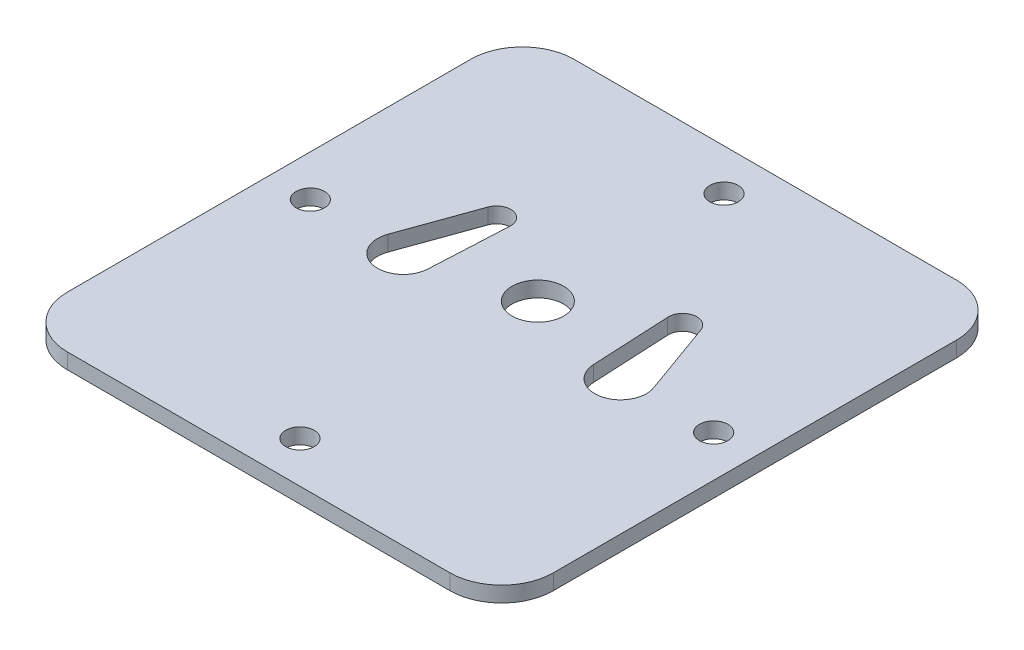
ISO-10303-21;
HEADER;
FILE_DESCRIPTION(('STEP AP214'),'2;1');
FILE_NAME('part.step','',(''),(''),'','','');
FILE_SCHEMA(('AUTOMOTIVE_DESIGN { 1 0 10303 214 1 1 1 1 }'));
ENDSEC;
DATA;
#1=APPLICATION_CONTEXT('core data for automotive mechanical design processes');
#2=APPLICATION_PROTOCOL_DEFINITION('international standard','automotive_design',2000,#1);
#3=PRODUCT_CONTEXT('',#1,'mechanical');
#4=PRODUCT('Part','Part','',(#3));
#5=PRODUCT_RELATED_PRODUCT_CATEGORY('part','',(#4));
#6=PRODUCT_DEFINITION_FORMATION('','',#4);
#7=PRODUCT_DEFINITION_CONTEXT('part definition',#1,'design');
#8=PRODUCT_DEFINITION('design','',#6,#7);
#9=PRODUCT_DEFINITION_SHAPE('','',#8);
#10=(LENGTH_UNIT() NAMED_UNIT(*) SI_UNIT(.MILLI.,.METRE.));
#11=(NAMED_UNIT(*) PLANE_ANGLE_UNIT() SI_UNIT($,.RADIAN.));
#12=(NAMED_UNIT(*) SI_UNIT($,.STERADIAN.) SOLID_ANGLE_UNIT());
#13=UNCERTAINTY_MEASURE_WITH_UNIT(LENGTH_MEASURE(1.E-05),#10,'distance_accuracy_value','');
#14=(GEOMETRIC_REPRESENTATION_CONTEXT(3) GLOBAL_UNCERTAINTY_ASSIGNED_CONTEXT((#13)) GLOBAL_UNIT_ASSIGNED_CONTEXT((#10,
#11,#12)) REPRESENTATION_CONTEXT('',''));
#15=CARTESIAN_POINT('',(0.,0.,0.));
#16=DIRECTION('',(0.,0.,1.));
#17=DIRECTION('',(1.,0.,0.));
#18=AXIS2_PLACEMENT_3D('',#15,#16,#17);
#19=CARTESIAN_POINT('',(10.,3.,-88.));
#20=DIRECTION('',(0.,-1.,0.));
#21=DIRECTION('',(0.,0.,-1.));
#22=AXIS2_PLACEMENT_3D('',#19,#20,#21);
#23=PLANE('',#22);
#24=CARTESIAN_POINT('',(65.,3.,-64.));
#25=DIRECTION('',(0.,1.,0.));
#26=DIRECTION('',(0.,0.,-1.));
#27=AXIS2_PLACEMENT_3D('',#24,#25,#26);
#28=CIRCLE('',#27,2.75);
#29=CARTESIAN_POINT('',(67.5879405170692,3.,-64.9300881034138));
#30=VERTEX_POINT('',#29);
#31=CARTESIAN_POINT('',(62.253405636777,3.,-63.8631811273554));
#32=VERTEX_POINT('',#31);
#33=EDGE_CURVE('E179',#30,#32,#28,.T.);
#34=ORIENTED_EDGE('',*,*,#33,.F.);
#35=DIRECTION('',(-0.338213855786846,0.,-0.941069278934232));
#36=VECTOR('',#35,1.);
#37=CARTESIAN_POINT('',(67.5879405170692,3.,-64.9300881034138));
#38=LINE('',#37,#36);
#39=CARTESIAN_POINT('',(72.7053463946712,3.,-50.6910692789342));
#40=VERTEX_POINT('',#39);
#41=EDGE_CURVE('E187',#40,#30,#38,.T.);
#42=ORIENTED_EDGE('',*,*,#41,.F.);
#43=CARTESIAN_POINT('',(68.,3.,-49.));
#44=DIRECTION('',(0.,1.,0.));
#45=DIRECTION('',(0.,0.,-1.));
#46=AXIS2_PLACEMENT_3D('',#43,#44,#45);
#47=CIRCLE('',#46,4.99999999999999);
#48=CARTESIAN_POINT('',(63.0061920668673,3.,-48.7512384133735));
#49=VERTEX_POINT('',#48);
#50=EDGE_CURVE('E184',#49,#40,#47,.T.);
#51=ORIENTED_EDGE('',*,*,#50,.F.);
#52=DIRECTION('',(0.0497523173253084,0.,0.998761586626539));
#53=VECTOR('',#52,1.);
#54=CARTESIAN_POINT('',(62.253405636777,3.,-63.8631811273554));
#55=LINE('',#54,#53);
#56=EDGE_CURVE('E181',#32,#49,#55,.T.);
#57=ORIENTED_EDGE('',*,*,#56,.F.);
#58=EDGE_LOOP('',(#34,#42,#51,#57));
#59=FACE_BOUND('',#58,.T.);
#60=CARTESIAN_POINT('',(8.,3.,-49.));
#61=DIRECTION('',(0.,1.,0.));
#62=DIRECTION('',(0.,0.,1.));
#63=AXIS2_PLACEMENT_3D('',#60,#61,#62);
#64=CIRCLE('',#63,2.75);
#65=CARTESIAN_POINT('',(8.,3.,-46.25));
#66=VERTEX_POINT('',#65);
#67=EDGE_CURVE('E216',#66,#66,#64,.T.);
#68=ORIENTED_EDGE('',*,*,#67,.F.);
#69=EDGE_LOOP('',(#68));
#70=FACE_BOUND('',#69,.T.);
#71=CARTESIAN_POINT('',(86.,3.,-49.));
#72=DIRECTION('',(0.,1.,0.));
#73=DIRECTION('',(0.,0.,1.));
#74=AXIS2_PLACEMENT_3D('',#71,#72,#73);
#75=CIRCLE('',#74,2.75000000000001);
#76=CARTESIAN_POINT('',(86.,3.,-46.25));
#77=VERTEX_POINT('',#76);
#78=EDGE_CURVE('E228',#77,#77,#75,.T.);
#79=ORIENTED_EDGE('',*,*,#78,.F.);
#80=EDGE_LOOP('',(#79));
#81=FACE_BOUND('',#80,.T.);
#82=CARTESIAN_POINT('',(10.,3.,-88.));
#83=DIRECTION('',(0.,1.,0.));
#84=DIRECTION('',(0.,0.,-1.));
#85=AXIS2_PLACEMENT_3D('',#82,#83,#84);
#86=CIRCLE('',#85,10.);
#87=CARTESIAN_POINT('',(10.0000000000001,3.,-98.));
#88=VERTEX_POINT('',#87);
#89=CARTESIAN_POINT('',(0.,3.,-87.9999999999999));
#90=VERTEX_POINT('',#89);
#91=EDGE_CURVE('E240',#88,#90,#86,.T.);
#92=ORIENTED_EDGE('',*,*,#91,.T.);
#93=DIRECTION('',(0.,0.,1.));
#94=VECTOR('',#93,1.);
#95=CARTESIAN_POINT('',(0.,3.,-10.0000000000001));
#96=LINE('',#95,#94);
#97=CARTESIAN_POINT('',(0.,3.,-10.0000000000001));
#98=VERTEX_POINT('',#97);
#99=EDGE_CURVE('E243',#90,#98,#96,.T.);
#100=ORIENTED_EDGE('',*,*,#99,.T.);
#101=CARTESIAN_POINT('',(10.,3.,-10.));
#102=DIRECTION('',(0.,1.,0.));
#103=DIRECTION('',(0.,0.,-1.));
#104=AXIS2_PLACEMENT_3D('',#101,#102,#103);
#105=CIRCLE('',#104,10.);
#106=CARTESIAN_POINT('',(10.0000000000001,3.,0.));
#107=VERTEX_POINT('',#106);
#108=EDGE_CURVE('E246',#98,#107,#105,.T.);
#109=ORIENTED_EDGE('',*,*,#108,.T.);
#110=DIRECTION('',(1.,0.,0.));
#111=VECTOR('',#110,1.);
#112=CARTESIAN_POINT('',(10.0000000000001,3.,0.));
#113=LINE('',#112,#111);
#114=CARTESIAN_POINT('',(83.9999999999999,3.,0.));
#115=VERTEX_POINT('',#114);
#116=EDGE_CURVE('E248',#107,#115,#113,.T.);
#117=ORIENTED_EDGE('',*,*,#116,.T.);
#118=CARTESIAN_POINT('',(84.,3.,-10.));
#119=DIRECTION('',(0.,1.,0.));
#120=DIRECTION('',(0.,0.,-1.));
#121=AXIS2_PLACEMENT_3D('',#118,#119,#120);
#122=CIRCLE('',#121,10.);
#123=CARTESIAN_POINT('',(94.,3.,-10.0000000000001));
#124=VERTEX_POINT('',#123);
#125=EDGE_CURVE('E250',#115,#124,#122,.T.);
#126=ORIENTED_EDGE('',*,*,#125,.T.);
#127=DIRECTION('',(0.,0.,-1.));
#128=VECTOR('',#127,1.);
#129=CARTESIAN_POINT('',(94.,3.,-10.0000000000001));
#130=LINE('',#129,#128);
#131=CARTESIAN_POINT('',(94.,3.,-87.9999999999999));
#132=VERTEX_POINT('',#131);
#133=EDGE_CURVE('E252',#124,#132,#130,.T.);
#134=ORIENTED_EDGE('',*,*,#133,.T.);
#135=CARTESIAN_POINT('',(84.,3.,-88.));
#136=DIRECTION('',(0.,1.,0.));
#137=DIRECTION('',(0.,0.,-1.));
#138=AXIS2_PLACEMENT_3D('',#135,#136,#137);
#139=CIRCLE('',#138,9.99999999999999);
#140=CARTESIAN_POINT('',(83.9999999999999,3.,-98.));
#141=VERTEX_POINT('',#140);
#142=EDGE_CURVE('E254',#132,#141,#139,.T.);
#143=ORIENTED_EDGE('',*,*,#142,.T.);
#144=DIRECTION('',(-1.,0.,0.));
#145=VECTOR('',#144,1.);
#146=CARTESIAN_POINT('',(10.0000000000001,3.,-98.));
#147=LINE('',#146,#145);
#148=EDGE_CURVE('E256',#141,#88,#147,.T.);
#149=ORIENTED_EDGE('',*,*,#148,.T.);
#150=EDGE_LOOP('',(#92,#100,#109,#117,#126,#134,#143,#149));
#151=FACE_BOUND('',#150,.T.);
#152=CARTESIAN_POINT('',(47.,3.,-90.));
#153=DIRECTION('',(0.,1.,0.));
#154=DIRECTION('',(0.,0.,1.));
#155=AXIS2_PLACEMENT_3D('',#152,#153,#154);
#156=CIRCLE('',#155,2.75);
#157=CARTESIAN_POINT('',(47.,3.,-87.25));
#158=VERTEX_POINT('',#157);
#159=EDGE_CURVE('E234',#158,#158,#156,.T.);
#160=ORIENTED_EDGE('',*,*,#159,.F.);
#161=EDGE_LOOP('',(#160));
#162=FACE_BOUND('',#161,.T.);
#163=CARTESIAN_POINT('',(47.,3.,-8.));
#164=DIRECTION('',(0.,1.,0.));
#165=DIRECTION('',(0.,0.,1.));
#166=AXIS2_PLACEMENT_3D('',#163,#164,#165);
#167=CIRCLE('',#166,2.75);
#168=CARTESIAN_POINT('',(47.,3.,-5.25));
#169=VERTEX_POINT('',#168);
#170=EDGE_CURVE('E222',#169,#169,#167,.T.);
#171=ORIENTED_EDGE('',*,*,#170,.F.);
#172=EDGE_LOOP('',(#171));
#173=FACE_BOUND('',#172,.T.);
#174=CARTESIAN_POINT('',(47.,3.,-54.));
#175=DIRECTION('',(0.,1.,0.));
#176=DIRECTION('',(0.,0.,1.));
#177=AXIS2_PLACEMENT_3D('',#174,#175,#176);
#178=CIRCLE('',#177,5.);
#179=CARTESIAN_POINT('',(47.,3.,-49.));
#180=VERTEX_POINT('',#179);
#181=EDGE_CURVE('E210',#180,#180,#178,.T.);
#182=ORIENTED_EDGE('',*,*,#181,.F.);
#183=EDGE_LOOP('',(#182));
#184=FACE_BOUND('',#183,.T.);
#185=CARTESIAN_POINT('',(29.,3.,-64.));
#186=DIRECTION('',(0.,1.,0.));
#187=DIRECTION('',(0.,0.,1.));
#188=AXIS2_PLACEMENT_3D('',#185,#186,#187);
#189=CIRCLE('',#188,2.75);
#190=CARTESIAN_POINT('',(31.746594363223,3.,-63.8631811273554));
#191=VERTEX_POINT('',#190);
#192=CARTESIAN_POINT('',(26.4120594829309,3.,-64.9300881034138));
#193=VERTEX_POINT('',#192);
#194=EDGE_CURVE('E143',#191,#193,#189,.T.);
#195=ORIENTED_EDGE('',*,*,#194,.F.);
#196=DIRECTION('',(0.0497523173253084,0.,-0.998761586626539));
#197=VECTOR('',#196,1.);
#198=CARTESIAN_POINT('',(31.746594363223,3.,-63.8631811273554));
#199=LINE('',#198,#197);
#200=CARTESIAN_POINT('',(30.9938079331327,3.,-48.7512384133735));
#201=VERTEX_POINT('',#200);
#202=EDGE_CURVE('E165',#201,#191,#199,.T.);
#203=ORIENTED_EDGE('',*,*,#202,.F.);
#204=CARTESIAN_POINT('',(26.,3.,-49.));
#205=DIRECTION('',(0.,1.,0.));
#206=DIRECTION('',(0.,0.,1.));
#207=AXIS2_PLACEMENT_3D('',#204,#205,#206);
#208=CIRCLE('',#207,4.99999999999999);
#209=CARTESIAN_POINT('',(21.2946536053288,3.,-50.6910692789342));
#210=VERTEX_POINT('',#209);
#211=EDGE_CURVE('E163',#210,#201,#208,.T.);
#212=ORIENTED_EDGE('',*,*,#211,.F.);
#213=DIRECTION('',(-0.338213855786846,0.,0.941069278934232));
#214=VECTOR('',#213,1.);
#215=CARTESIAN_POINT('',(26.4120594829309,3.,-64.9300881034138));
#216=LINE('',#215,#214);
#217=EDGE_CURVE('E151',#193,#210,#216,.T.);
#218=ORIENTED_EDGE('',*,*,#217,.F.);
#219=EDGE_LOOP('',(#195,#203,#212,#218));
#220=FACE_BOUND('',#219,.T.);
#221=ADVANCED_FACE('F30',(#59,#70,#81,#151,#162,#173,#184,#220),#23,.F.);
#222=CARTESIAN_POINT('',(10.,0.,-88.));
#223=DIRECTION('',(0.,-1.,0.));
#224=DIRECTION('',(0.,0.,-1.));
#225=AXIS2_PLACEMENT_3D('',#222,#223,#224);
#226=PLANE('',#225);
#227=DIRECTION('',(-0.338213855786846,0.,-0.941069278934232));
#228=VECTOR('',#227,1.);
#229=CARTESIAN_POINT('',(67.5879405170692,0.,-64.9300881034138));
#230=LINE('',#229,#228);
#231=CARTESIAN_POINT('',(72.7053463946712,0.,-50.6910692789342));
#232=VERTEX_POINT('',#231);
#233=CARTESIAN_POINT('',(67.5879405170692,0.,-64.9300881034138));
#234=VERTEX_POINT('',#233);
#235=EDGE_CURVE('E182',#232,#234,#230,.T.);
#236=ORIENTED_EDGE('',*,*,#235,.T.);
#237=CARTESIAN_POINT('',(65.,0.,-64.));
#238=DIRECTION('',(0.,1.,0.));
#239=DIRECTION('',(0.,0.,-1.));
#240=AXIS2_PLACEMENT_3D('',#237,#238,#239);
#241=CIRCLE('',#240,2.75);
#242=CARTESIAN_POINT('',(62.253405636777,0.,-63.8631811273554));
#243=VERTEX_POINT('',#242);
#244=EDGE_CURVE('E159',#234,#243,#241,.T.);
#245=ORIENTED_EDGE('',*,*,#244,.T.);
#246=DIRECTION('',(0.0497523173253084,0.,0.998761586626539));
#247=VECTOR('',#246,1.);
#248=CARTESIAN_POINT('',(62.253405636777,0.,-63.8631811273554));
#249=LINE('',#248,#247);
#250=CARTESIAN_POINT('',(63.0061920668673,0.,-48.7512384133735));
#251=VERTEX_POINT('',#250);
#252=EDGE_CURVE('E192',#243,#251,#249,.T.);
#253=ORIENTED_EDGE('',*,*,#252,.T.);
#254=CARTESIAN_POINT('',(68.,0.,-49.));
#255=DIRECTION('',(0.,1.,0.));
#256=DIRECTION('',(0.,0.,-1.));
#257=AXIS2_PLACEMENT_3D('',#254,#255,#256);
#258=CIRCLE('',#257,4.99999999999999);
#259=EDGE_CURVE('E195',#251,#232,#258,.T.);
#260=ORIENTED_EDGE('',*,*,#259,.T.);
#261=EDGE_LOOP('',(#236,#245,#253,#260));
#262=FACE_BOUND('',#261,.T.);
#263=CARTESIAN_POINT('',(8.,0.,-49.));
#264=DIRECTION('',(0.,1.,0.));
#265=DIRECTION('',(0.,0.,1.));
#266=AXIS2_PLACEMENT_3D('',#263,#264,#265);
#267=CIRCLE('',#266,2.75);
#268=CARTESIAN_POINT('',(8.,0.,-46.25));
#269=VERTEX_POINT('',#268);
#270=EDGE_CURVE('E213',#269,#269,#267,.T.);
#271=ORIENTED_EDGE('',*,*,#270,.T.);
#272=EDGE_LOOP('',(#271));
#273=FACE_BOUND('',#272,.T.);
#274=CARTESIAN_POINT('',(86.,0.,-49.));
#275=DIRECTION('',(0.,1.,0.));
#276=DIRECTION('',(0.,0.,1.));
#277=AXIS2_PLACEMENT_3D('',#274,#275,#276);
#278=CIRCLE('',#277,2.75000000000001);
#279=CARTESIAN_POINT('',(86.,0.,-46.25));
#280=VERTEX_POINT('',#279);
#281=EDGE_CURVE('E225',#280,#280,#278,.T.);
#282=ORIENTED_EDGE('',*,*,#281,.T.);
#283=EDGE_LOOP('',(#282));
#284=FACE_BOUND('',#283,.T.);
#285=CARTESIAN_POINT('',(10.,0.,-88.));
#286=DIRECTION('',(0.,1.,0.));
#287=DIRECTION('',(0.,0.,-1.));
#288=AXIS2_PLACEMENT_3D('',#285,#286,#287);
#289=CIRCLE('',#288,10.);
#290=CARTESIAN_POINT('',(10.0000000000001,0.,-98.));
#291=VERTEX_POINT('',#290);
#292=CARTESIAN_POINT('',(0.,0.,-87.9999999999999));
#293=VERTEX_POINT('',#292);
#294=EDGE_CURVE('E237',#291,#293,#289,.T.);
#295=ORIENTED_EDGE('',*,*,#294,.F.);
#296=DIRECTION('',(-1.,0.,0.));
#297=VECTOR('',#296,1.);
#298=CARTESIAN_POINT('',(10.0000000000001,0.,-98.));
#299=LINE('',#298,#297);
#300=CARTESIAN_POINT('',(83.9999999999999,0.,-98.));
#301=VERTEX_POINT('',#300);
#302=EDGE_CURVE('E244',#301,#291,#299,.T.);
#303=ORIENTED_EDGE('',*,*,#302,.F.);
#304=CARTESIAN_POINT('',(84.,0.,-88.));
#305=DIRECTION('',(0.,1.,0.));
#306=DIRECTION('',(0.,0.,-1.));
#307=AXIS2_PLACEMENT_3D('',#304,#305,#306);
#308=CIRCLE('',#307,9.99999999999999);
#309=CARTESIAN_POINT('',(94.,0.,-87.9999999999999));
#310=VERTEX_POINT('',#309);
#311=EDGE_CURVE('E271',#310,#301,#308,.T.);
#312=ORIENTED_EDGE('',*,*,#311,.F.);
#313=DIRECTION('',(0.,0.,-1.));
#314=VECTOR('',#313,1.);
#315=CARTESIAN_POINT('',(94.,0.,-10.0000000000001));
#316=LINE('',#315,#314);
#317=CARTESIAN_POINT('',(94.,0.,-10.0000000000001));
#318=VERTEX_POINT('',#317);
#319=EDGE_CURVE('E269',#318,#310,#316,.T.);
#320=ORIENTED_EDGE('',*,*,#319,.F.);
#321=CARTESIAN_POINT('',(84.,0.,-10.));
#322=DIRECTION('',(0.,1.,0.));
#323=DIRECTION('',(0.,0.,-1.));
#324=AXIS2_PLACEMENT_3D('',#321,#322,#323);
#325=CIRCLE('',#324,10.);
#326=CARTESIAN_POINT('',(83.9999999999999,0.,0.));
#327=VERTEX_POINT('',#326);
#328=EDGE_CURVE('E267',#327,#318,#325,.T.);
#329=ORIENTED_EDGE('',*,*,#328,.F.);
#330=DIRECTION('',(1.,0.,0.));
#331=VECTOR('',#330,1.);
#332=CARTESIAN_POINT('',(10.0000000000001,0.,0.));
#333=LINE('',#332,#331);
#334=CARTESIAN_POINT('',(10.0000000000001,0.,0.));
#335=VERTEX_POINT('',#334);
#336=EDGE_CURVE('E265',#335,#327,#333,.T.);
#337=ORIENTED_EDGE('',*,*,#336,.F.);
#338=CARTESIAN_POINT('',(10.,0.,-10.));
#339=DIRECTION('',(0.,1.,0.));
#340=DIRECTION('',(0.,0.,-1.));
#341=AXIS2_PLACEMENT_3D('',#338,#339,#340);
#342=CIRCLE('',#341,10.);
#343=CARTESIAN_POINT('',(0.,0.,-10.0000000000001));
#344=VERTEX_POINT('',#343);
#345=EDGE_CURVE('E263',#344,#335,#342,.T.);
#346=ORIENTED_EDGE('',*,*,#345,.F.);
#347=DIRECTION('',(0.,0.,1.));
#348=VECTOR('',#347,1.);
#349=CARTESIAN_POINT('',(0.,0.,-10.0000000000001));
#350=LINE('',#349,#348);
#351=EDGE_CURVE('E261',#293,#344,#350,.T.);
#352=ORIENTED_EDGE('',*,*,#351,.F.);
#353=EDGE_LOOP('',(#295,#303,#312,#320,#329,#337,#346,#352));
#354=FACE_BOUND('',#353,.T.);
#355=CARTESIAN_POINT('',(47.,0.,-90.));
#356=DIRECTION('',(0.,1.,0.));
#357=DIRECTION('',(0.,0.,1.));
#358=AXIS2_PLACEMENT_3D('',#355,#356,#357);
#359=CIRCLE('',#358,2.75);
#360=CARTESIAN_POINT('',(47.,0.,-87.25));
#361=VERTEX_POINT('',#360);
#362=EDGE_CURVE('E231',#361,#361,#359,.T.);
#363=ORIENTED_EDGE('',*,*,#362,.T.);
#364=EDGE_LOOP('',(#363));
#365=FACE_BOUND('',#364,.T.);
#366=CARTESIAN_POINT('',(47.,0.,-8.));
#367=DIRECTION('',(0.,1.,0.));
#368=DIRECTION('',(0.,0.,1.));
#369=AXIS2_PLACEMENT_3D('',#366,#367,#368);
#370=CIRCLE('',#369,2.75);
#371=CARTESIAN_POINT('',(47.,0.,-5.25));
#372=VERTEX_POINT('',#371);
#373=EDGE_CURVE('E219',#372,#372,#370,.T.);
#374=ORIENTED_EDGE('',*,*,#373,.T.);
#375=EDGE_LOOP('',(#374));
#376=FACE_BOUND('',#375,.T.);
#377=CARTESIAN_POINT('',(47.,0.,-54.));
#378=DIRECTION('',(0.,1.,0.));
#379=DIRECTION('',(0.,0.,1.));
#380=AXIS2_PLACEMENT_3D('',#377,#378,#379);
#381=CIRCLE('',#380,5.);
#382=CARTESIAN_POINT('',(47.,0.,-49.));
#383=VERTEX_POINT('',#382);
#384=EDGE_CURVE('E209',#383,#383,#381,.T.);
#385=ORIENTED_EDGE('',*,*,#384,.T.);
#386=EDGE_LOOP('',(#385));
#387=FACE_BOUND('',#386,.T.);
#388=DIRECTION('',(0.0497523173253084,0.,-0.998761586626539));
#389=VECTOR('',#388,1.);
#390=CARTESIAN_POINT('',(31.746594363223,0.,-63.8631811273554));
#391=LINE('',#390,#389);
#392=CARTESIAN_POINT('',(30.9938079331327,0.,-48.7512384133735));
#393=VERTEX_POINT('',#392);
#394=CARTESIAN_POINT('',(31.746594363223,0.,-63.8631811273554));
#395=VERTEX_POINT('',#394);
#396=EDGE_CURVE('E152',#393,#395,#391,.T.);
#397=ORIENTED_EDGE('',*,*,#396,.T.);
#398=CARTESIAN_POINT('',(29.,0.,-64.));
#399=DIRECTION('',(0.,1.,0.));
#400=DIRECTION('',(0.,0.,1.));
#401=AXIS2_PLACEMENT_3D('',#398,#399,#400);
#402=CIRCLE('',#401,2.75);
#403=CARTESIAN_POINT('',(26.4120594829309,0.,-64.9300881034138));
#404=VERTEX_POINT('',#403);
#405=EDGE_CURVE('E53',#395,#404,#402,.T.);
#406=ORIENTED_EDGE('',*,*,#405,.T.);
#407=DIRECTION('',(-0.338213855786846,0.,0.941069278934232));
#408=VECTOR('',#407,1.);
#409=CARTESIAN_POINT('',(26.4120594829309,0.,-64.9300881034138));
#410=LINE('',#409,#408);
#411=CARTESIAN_POINT('',(21.2946536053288,0.,-50.6910692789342));
#412=VERTEX_POINT('',#411);
#413=EDGE_CURVE('E158',#404,#412,#410,.T.);
#414=ORIENTED_EDGE('',*,*,#413,.T.);
#415=CARTESIAN_POINT('',(26.,0.,-49.));
#416=DIRECTION('',(0.,1.,0.));
#417=DIRECTION('',(0.,0.,1.));
#418=AXIS2_PLACEMENT_3D('',#415,#416,#417);
#419=CIRCLE('',#418,4.99999999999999);
#420=EDGE_CURVE('E171',#412,#393,#419,.T.);
#421=ORIENTED_EDGE('',*,*,#420,.T.);
#422=EDGE_LOOP('',(#397,#406,#414,#421));
#423=FACE_BOUND('',#422,.T.);
#424=ADVANCED_FACE('F301',(#262,#273,#284,#354,#365,#376,#387,#423),#226,.T.);
#425=CARTESIAN_POINT('',(10.,3.,-88.));
#426=DIRECTION('',(0.,-1.,0.));
#427=DIRECTION('',(0.,0.,-1.));
#428=AXIS2_PLACEMENT_3D('',#425,#426,#427);
#429=CYLINDRICAL_SURFACE('',#428,10.);
#430=ORIENTED_EDGE('',*,*,#294,.T.);
#431=DIRECTION('',(0.,-1.,0.));
#432=VECTOR('',#431,1.);
#433=CARTESIAN_POINT('',(0.,3.,-87.9999999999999));
#434=LINE('',#433,#432);
#435=EDGE_CURVE('E11',#90,#293,#434,.T.);
#436=ORIENTED_EDGE('',*,*,#435,.F.);
#437=ORIENTED_EDGE('',*,*,#91,.F.);
#438=DIRECTION('',(0.,-1.,0.));
#439=VECTOR('',#438,1.);
#440=CARTESIAN_POINT('',(10.0000000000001,3.,-98.));
#441=LINE('',#440,#439);
#442=EDGE_CURVE('E258',#88,#291,#441,.T.);
#443=ORIENTED_EDGE('',*,*,#442,.T.);
#444=EDGE_LOOP('',(#430,#436,#437,#443));
#445=FACE_BOUND('',#444,.T.);
#446=ADVANCED_FACE('F32',(#445),#429,.T.);
#447=CARTESIAN_POINT('',(0.,3.,-10.0000000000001));
#448=DIRECTION('',(1.,0.,0.));
#449=DIRECTION('',(0.,0.,-1.));
#450=AXIS2_PLACEMENT_3D('',#447,#448,#449);
#451=PLANE('',#450);
#452=ORIENTED_EDGE('',*,*,#351,.T.);
#453=DIRECTION('',(0.,-1.,0.));
#454=VECTOR('',#453,1.);
#455=CARTESIAN_POINT('',(0.,3.,-10.0000000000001));
#456=LINE('',#455,#454);
#457=EDGE_CURVE('E38',#98,#344,#456,.T.);
#458=ORIENTED_EDGE('',*,*,#457,.F.);
#459=ORIENTED_EDGE('',*,*,#99,.F.);
#460=ORIENTED_EDGE('',*,*,#435,.T.);
#461=EDGE_LOOP('',(#452,#458,#459,#460));
#462=FACE_BOUND('',#461,.T.);
#463=ADVANCED_FACE('F319',(#462),#451,.F.);
#464=CARTESIAN_POINT('',(10.,3.,-10.));
#465=DIRECTION('',(0.,-1.,0.));
#466=DIRECTION('',(0.,0.,-1.));
#467=AXIS2_PLACEMENT_3D('',#464,#465,#466);
#468=CYLINDRICAL_SURFACE('',#467,10.);
#469=ORIENTED_EDGE('',*,*,#345,.T.);
#470=DIRECTION('',(0.,-1.,0.));
#471=VECTOR('',#470,1.);
#472=CARTESIAN_POINT('',(10.0000000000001,3.,0.));
#473=LINE('',#472,#471);
#474=EDGE_CURVE('E288',#107,#335,#473,.T.);
#475=ORIENTED_EDGE('',*,*,#474,.F.);
#476=ORIENTED_EDGE('',*,*,#108,.F.);
#477=ORIENTED_EDGE('',*,*,#457,.T.);
#478=EDGE_LOOP('',(#469,#475,#476,#477));
#479=FACE_BOUND('',#478,.T.);
#480=ADVANCED_FACE('F295',(#479),#468,.T.);
#481=CARTESIAN_POINT('',(10.0000000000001,3.,0.));
#482=DIRECTION('',(0.,0.,-1.));
#483=DIRECTION('',(-1.,0.,0.));
#484=AXIS2_PLACEMENT_3D('',#481,#482,#483);
#485=PLANE('',#484);
#486=ORIENTED_EDGE('',*,*,#336,.T.);
#487=DIRECTION('',(0.,-1.,0.));
#488=VECTOR('',#487,1.);
#489=CARTESIAN_POINT('',(83.9999999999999,3.,0.));
#490=LINE('',#489,#488);
#491=EDGE_CURVE('E285',#115,#327,#490,.T.);
#492=ORIENTED_EDGE('',*,*,#491,.F.);
#493=ORIENTED_EDGE('',*,*,#116,.F.);
#494=ORIENTED_EDGE('',*,*,#474,.T.);
#495=EDGE_LOOP('',(#486,#492,#493,#494));
#496=FACE_BOUND('',#495,.T.);
#497=ADVANCED_FACE('F307',(#496),#485,.F.);
#498=CARTESIAN_POINT('',(84.,3.,-10.));
#499=DIRECTION('',(0.,-1.,0.));
#500=DIRECTION('',(0.,0.,-1.));
#501=AXIS2_PLACEMENT_3D('',#498,#499,#500);
#502=CYLINDRICAL_SURFACE('',#501,10.);
#503=ORIENTED_EDGE('',*,*,#328,.T.);
#504=DIRECTION('',(0.,-1.,0.));
#505=VECTOR('',#504,1.);
#506=CARTESIAN_POINT('',(94.,3.,-10.0000000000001));
#507=LINE('',#506,#505);
#508=EDGE_CURVE('E282',#124,#318,#507,.T.);
#509=ORIENTED_EDGE('',*,*,#508,.F.);
#510=ORIENTED_EDGE('',*,*,#125,.F.);
#511=ORIENTED_EDGE('',*,*,#491,.T.);
#512=EDGE_LOOP('',(#503,#509,#510,#511));
#513=FACE_BOUND('',#512,.T.);
#514=ADVANCED_FACE('F311',(#513),#502,.T.);
#515=CARTESIAN_POINT('',(94.,3.,-10.0000000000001));
#516=DIRECTION('',(-1.,0.,0.));
#517=DIRECTION('',(0.,0.,1.));
#518=AXIS2_PLACEMENT_3D('',#515,#516,#517);
#519=PLANE('',#518);
#520=ORIENTED_EDGE('',*,*,#319,.T.);
#521=DIRECTION('',(0.,-1.,0.));
#522=VECTOR('',#521,1.);
#523=CARTESIAN_POINT('',(94.,3.,-87.9999999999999));
#524=LINE('',#523,#522);
#525=EDGE_CURVE('E279',#132,#310,#524,.T.);
#526=ORIENTED_EDGE('',*,*,#525,.F.);
#527=ORIENTED_EDGE('',*,*,#133,.F.);
#528=ORIENTED_EDGE('',*,*,#508,.T.);
#529=EDGE_LOOP('',(#520,#526,#527,#528));
#530=FACE_BOUND('',#529,.T.);
#531=ADVANCED_FACE('F332',(#530),#519,.F.);
#532=CARTESIAN_POINT('',(84.,3.,-88.));
#533=DIRECTION('',(0.,-1.,0.));
#534=DIRECTION('',(0.,0.,-1.));
#535=AXIS2_PLACEMENT_3D('',#532,#533,#534);
#536=CYLINDRICAL_SURFACE('',#535,9.99999999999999);
#537=ORIENTED_EDGE('',*,*,#311,.T.);
#538=DIRECTION('',(0.,-1.,0.));
#539=VECTOR('',#538,1.);
#540=CARTESIAN_POINT('',(83.9999999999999,3.,-98.));
#541=LINE('',#540,#539);
#542=EDGE_CURVE('E276',#141,#301,#541,.T.);
#543=ORIENTED_EDGE('',*,*,#542,.F.);
#544=ORIENTED_EDGE('',*,*,#142,.F.);
#545=ORIENTED_EDGE('',*,*,#525,.T.);
#546=EDGE_LOOP('',(#537,#543,#544,#545));
#547=FACE_BOUND('',#546,.T.);
#548=ADVANCED_FACE('F330',(#547),#536,.T.);
#549=CARTESIAN_POINT('',(10.0000000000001,3.,-98.));
#550=DIRECTION('',(0.,0.,1.));
#551=DIRECTION('',(1.,0.,0.));
#552=AXIS2_PLACEMENT_3D('',#549,#550,#551);
#553=PLANE('',#552);
#554=ORIENTED_EDGE('',*,*,#302,.T.);
#555=ORIENTED_EDGE('',*,*,#442,.F.);
#556=ORIENTED_EDGE('',*,*,#148,.F.);
#557=ORIENTED_EDGE('',*,*,#542,.T.);
#558=EDGE_LOOP('',(#554,#555,#556,#557));
#559=FACE_BOUND('',#558,.T.);
#560=ADVANCED_FACE('F325',(#559),#553,.F.);
#561=CARTESIAN_POINT('',(47.,3.,-90.));
#562=DIRECTION('',(0.,-1.,0.));
#563=DIRECTION('',(0.,0.,-1.));
#564=AXIS2_PLACEMENT_3D('',#561,#562,#563);
#565=CYLINDRICAL_SURFACE('',#564,2.75);
#566=ORIENTED_EDGE('',*,*,#159,.T.);
#567=EDGE_LOOP('',(#566));
#568=FACE_BOUND('',#567,.T.);
#569=ORIENTED_EDGE('',*,*,#362,.F.);
#570=EDGE_LOOP('',(#569));
#571=FACE_BOUND('',#570,.T.);
#572=ADVANCED_FACE('F352',(#568,#571),#565,.F.);
#573=CARTESIAN_POINT('',(86.,3.,-49.));
#574=DIRECTION('',(0.,-1.,0.));
#575=DIRECTION('',(0.,0.,-1.));
#576=AXIS2_PLACEMENT_3D('',#573,#574,#575);
#577=CYLINDRICAL_SURFACE('',#576,2.75000000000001);
#578=ORIENTED_EDGE('',*,*,#78,.T.);
#579=EDGE_LOOP('',(#578));
#580=FACE_BOUND('',#579,.T.);
#581=ORIENTED_EDGE('',*,*,#281,.F.);
#582=EDGE_LOOP('',(#581));
#583=FACE_BOUND('',#582,.T.);
#584=ADVANCED_FACE('F359',(#580,#583),#577,.F.);
#585=CARTESIAN_POINT('',(47.,3.,-8.));
#586=DIRECTION('',(0.,-1.,0.));
#587=DIRECTION('',(0.,0.,-1.));
#588=AXIS2_PLACEMENT_3D('',#585,#586,#587);
#589=CYLINDRICAL_SURFACE('',#588,2.75);
#590=ORIENTED_EDGE('',*,*,#170,.T.);
#591=EDGE_LOOP('',(#590));
#592=FACE_BOUND('',#591,.T.);
#593=ORIENTED_EDGE('',*,*,#373,.F.);
#594=EDGE_LOOP('',(#593));
#595=FACE_BOUND('',#594,.T.);
#596=ADVANCED_FACE('F364',(#592,#595),#589,.F.);
#597=CARTESIAN_POINT('',(8.,3.,-49.));
#598=DIRECTION('',(0.,-1.,0.));
#599=DIRECTION('',(0.,0.,-1.));
#600=AXIS2_PLACEMENT_3D('',#597,#598,#599);
#601=CYLINDRICAL_SURFACE('',#600,2.75);
#602=ORIENTED_EDGE('',*,*,#67,.T.);
#603=EDGE_LOOP('',(#602));
#604=FACE_BOUND('',#603,.T.);
#605=ORIENTED_EDGE('',*,*,#270,.F.);
#606=EDGE_LOOP('',(#605));
#607=FACE_BOUND('',#606,.T.);
#608=ADVANCED_FACE('F408',(#604,#607),#601,.F.);
#609=CARTESIAN_POINT('',(47.,3.,-54.));
#610=DIRECTION('',(0.,-1.,0.));
#611=DIRECTION('',(0.,0.,-1.));
#612=AXIS2_PLACEMENT_3D('',#609,#610,#611);
#613=CYLINDRICAL_SURFACE('',#612,5.);
#614=ORIENTED_EDGE('',*,*,#181,.T.);
#615=EDGE_LOOP('',(#614));
#616=FACE_BOUND('',#615,.T.);
#617=ORIENTED_EDGE('',*,*,#384,.F.);
#618=EDGE_LOOP('',(#617));
#619=FACE_BOUND('',#618,.T.);
#620=ADVANCED_FACE('F404',(#616,#619),#613,.F.);
#621=CARTESIAN_POINT('',(65.,3.,-64.));
#622=DIRECTION('',(0.,-1.,0.));
#623=DIRECTION('',(0.,0.,-1.));
#624=AXIS2_PLACEMENT_3D('',#621,#622,#623);
#625=CYLINDRICAL_SURFACE('',#624,2.75);
#626=ORIENTED_EDGE('',*,*,#244,.F.);
#627=DIRECTION('',(0.,-1.,0.));
#628=VECTOR('',#627,1.);
#629=CARTESIAN_POINT('',(67.5879405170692,3.,-64.9300881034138));
#630=LINE('',#629,#628);
#631=EDGE_CURVE('E189',#30,#234,#630,.T.);
#632=ORIENTED_EDGE('',*,*,#631,.F.);
#633=ORIENTED_EDGE('',*,*,#33,.T.);
#634=DIRECTION('',(0.,-1.,0.));
#635=VECTOR('',#634,1.);
#636=CARTESIAN_POINT('',(62.253405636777,3.,-63.8631811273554));
#637=LINE('',#636,#635);
#638=EDGE_CURVE('E206',#32,#243,#637,.T.);
#639=ORIENTED_EDGE('',*,*,#638,.T.);
#640=EDGE_LOOP('',(#626,#632,#633,#639));
#641=FACE_BOUND('',#640,.T.);
#642=ADVANCED_FACE('F400',(#641),#625,.F.);
#643=CARTESIAN_POINT('',(62.253405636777,3.,-63.8631811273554));
#644=DIRECTION('',(0.998761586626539,0.,-0.0497523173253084));
#645=DIRECTION('',(-0.0497523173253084,0.,-0.998761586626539));
#646=AXIS2_PLACEMENT_3D('',#643,#644,#645);
#647=PLANE('',#646);
#648=ORIENTED_EDGE('',*,*,#252,.F.);
#649=ORIENTED_EDGE('',*,*,#638,.F.);
#650=ORIENTED_EDGE('',*,*,#56,.T.);
#651=DIRECTION('',(0.,-1.,0.));
#652=VECTOR('',#651,1.);
#653=CARTESIAN_POINT('',(63.0061920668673,3.,-48.7512384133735));
#654=LINE('',#653,#652);
#655=EDGE_CURVE('E204',#49,#251,#654,.T.);
#656=ORIENTED_EDGE('',*,*,#655,.T.);
#657=EDGE_LOOP('',(#648,#649,#650,#656));
#658=FACE_BOUND('',#657,.T.);
#659=ADVANCED_FACE('F396',(#658),#647,.T.);
#660=CARTESIAN_POINT('',(68.,3.,-49.));
#661=DIRECTION('',(0.,-1.,0.));
#662=DIRECTION('',(0.,0.,-1.));
#663=AXIS2_PLACEMENT_3D('',#660,#661,#662);
#664=CYLINDRICAL_SURFACE('',#663,4.99999999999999);
#665=ORIENTED_EDGE('',*,*,#259,.F.);
#666=ORIENTED_EDGE('',*,*,#655,.F.);
#667=ORIENTED_EDGE('',*,*,#50,.T.);
#668=DIRECTION('',(0.,-1.,0.));
#669=VECTOR('',#668,1.);
#670=CARTESIAN_POINT('',(72.7053463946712,3.,-50.6910692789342));
#671=LINE('',#670,#669);
#672=EDGE_CURVE('E202',#40,#232,#671,.T.);
#673=ORIENTED_EDGE('',*,*,#672,.T.);
#674=EDGE_LOOP('',(#665,#666,#667,#673));
#675=FACE_BOUND('',#674,.T.);
#676=ADVANCED_FACE('F392',(#675),#664,.F.);
#677=CARTESIAN_POINT('',(67.5879405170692,3.,-64.9300881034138));
#678=DIRECTION('',(-0.941069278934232,0.,0.338213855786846));
#679=DIRECTION('',(0.338213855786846,0.,0.941069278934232));
#680=AXIS2_PLACEMENT_3D('',#677,#678,#679);
#681=PLANE('',#680);
#682=ORIENTED_EDGE('',*,*,#235,.F.);
#683=ORIENTED_EDGE('',*,*,#672,.F.);
#684=ORIENTED_EDGE('',*,*,#41,.T.);
#685=ORIENTED_EDGE('',*,*,#631,.T.);
#686=EDGE_LOOP('',(#682,#683,#684,#685));
#687=FACE_BOUND('',#686,.T.);
#688=ADVANCED_FACE('F389',(#687),#681,.T.);
#689=CARTESIAN_POINT('',(29.,3.,-64.));
#690=DIRECTION('',(0.,-1.,0.));
#691=DIRECTION('',(0.,0.,-1.));
#692=AXIS2_PLACEMENT_3D('',#689,#690,#691);
#693=CYLINDRICAL_SURFACE('',#692,2.75);
#694=ORIENTED_EDGE('',*,*,#405,.F.);
#695=DIRECTION('',(0.,-1.,0.));
#696=VECTOR('',#695,1.);
#697=CARTESIAN_POINT('',(31.746594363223,3.,-63.8631811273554));
#698=LINE('',#697,#696);
#699=EDGE_CURVE('E147',#191,#395,#698,.T.);
#700=ORIENTED_EDGE('',*,*,#699,.F.);
#701=ORIENTED_EDGE('',*,*,#194,.T.);
#702=DIRECTION('',(0.,-1.,0.));
#703=VECTOR('',#702,1.);
#704=CARTESIAN_POINT('',(26.4120594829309,3.,-64.9300881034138));
#705=LINE('',#704,#703);
#706=EDGE_CURVE('E146',#193,#404,#705,.T.);
#707=ORIENTED_EDGE('',*,*,#706,.T.);
#708=EDGE_LOOP('',(#694,#700,#701,#707));
#709=FACE_BOUND('',#708,.T.);
#710=ADVANCED_FACE('F145',(#709),#693,.F.);
#711=CARTESIAN_POINT('',(26.4120594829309,3.,-64.9300881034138));
#712=DIRECTION('',(0.941069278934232,0.,0.338213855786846));
#713=DIRECTION('',(0.338213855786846,0.,-0.941069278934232));
#714=AXIS2_PLACEMENT_3D('',#711,#712,#713);
#715=PLANE('',#714);
#716=ORIENTED_EDGE('',*,*,#413,.F.);
#717=ORIENTED_EDGE('',*,*,#706,.F.);
#718=ORIENTED_EDGE('',*,*,#217,.T.);
#719=DIRECTION('',(0.,-1.,0.));
#720=VECTOR('',#719,1.);
#721=CARTESIAN_POINT('',(21.2946536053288,3.,-50.6910692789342));
#722=LINE('',#721,#720);
#723=EDGE_CURVE('E160',#210,#412,#722,.T.);
#724=ORIENTED_EDGE('',*,*,#723,.T.);
#725=EDGE_LOOP('',(#716,#717,#718,#724));
#726=FACE_BOUND('',#725,.T.);
#727=ADVANCED_FACE('F155',(#726),#715,.T.);
#728=CARTESIAN_POINT('',(26.,3.,-49.));
#729=DIRECTION('',(0.,-1.,0.));
#730=DIRECTION('',(0.,0.,-1.));
#731=AXIS2_PLACEMENT_3D('',#728,#729,#730);
#732=CYLINDRICAL_SURFACE('',#731,4.99999999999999);
#733=ORIENTED_EDGE('',*,*,#420,.F.);
#734=ORIENTED_EDGE('',*,*,#723,.F.);
#735=ORIENTED_EDGE('',*,*,#211,.T.);
#736=DIRECTION('',(0.,-1.,0.));
#737=VECTOR('',#736,1.);
#738=CARTESIAN_POINT('',(30.9938079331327,3.,-48.7512384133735));
#739=LINE('',#738,#737);
#740=EDGE_CURVE('E45',#201,#393,#739,.T.);
#741=ORIENTED_EDGE('',*,*,#740,.T.);
#742=EDGE_LOOP('',(#733,#734,#735,#741));
#743=FACE_BOUND('',#742,.T.);
#744=ADVANCED_FACE('F377',(#743),#732,.F.);
#745=CARTESIAN_POINT('',(31.746594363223,3.,-63.8631811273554));
#746=DIRECTION('',(-0.998761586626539,0.,-0.0497523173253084));
#747=DIRECTION('',(-0.0497523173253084,0.,0.998761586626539));
#748=AXIS2_PLACEMENT_3D('',#745,#746,#747);
#749=PLANE('',#748);
#750=ORIENTED_EDGE('',*,*,#396,.F.);
#751=ORIENTED_EDGE('',*,*,#740,.F.);
#752=ORIENTED_EDGE('',*,*,#202,.T.);
#753=ORIENTED_EDGE('',*,*,#699,.T.);
#754=EDGE_LOOP('',(#750,#751,#752,#753));
#755=FACE_BOUND('',#754,.T.);
#756=ADVANCED_FACE('F375',(#755),#749,.T.);
#757=CLOSED_SHELL('',(#221,#424,#446,#463,#480,#497,#514,#531,#548,#560,#572,#584,#596,#608,
#620,#642,#659,#676,#688,#710,#727,#744,#756));
#758=MANIFOLD_SOLID_BREP('B2',#757);
#759=ADVANCED_BREP_SHAPE_REPRESENTATION('',(#18,#758),#14);
#760=SHAPE_DEFINITION_REPRESENTATION(#9,#759);
ENDSEC;
END-ISO-10303-21;
